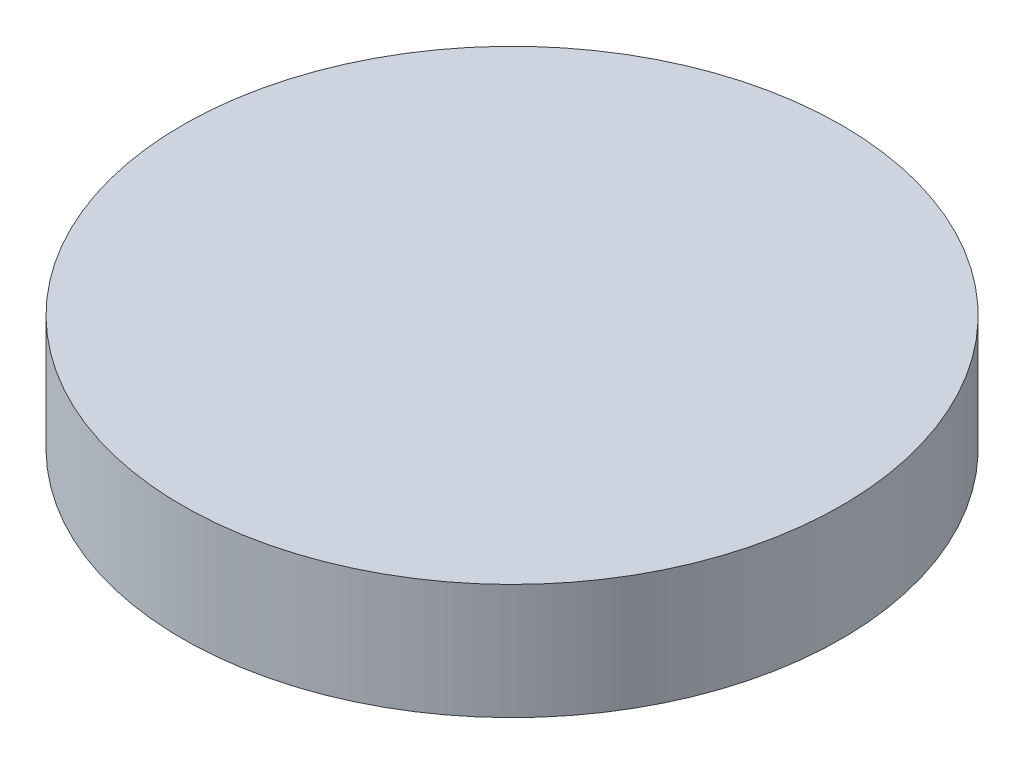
ISO-10303-21;
HEADER;
FILE_DESCRIPTION(('STEP AP214'),'2;1');
FILE_NAME('part.step','',(''),(''),'','','');
FILE_SCHEMA(('AUTOMOTIVE_DESIGN { 1 0 10303 214 1 1 1 1 }'));
ENDSEC;
DATA;
#1=APPLICATION_CONTEXT('core data for automotive mechanical design processes');
#2=APPLICATION_PROTOCOL_DEFINITION('international standard','automotive_design',2000,#1);
#3=PRODUCT_CONTEXT('',#1,'mechanical');
#4=PRODUCT('Part','Part','',(#3));
#5=PRODUCT_RELATED_PRODUCT_CATEGORY('part','',(#4));
#6=PRODUCT_DEFINITION_FORMATION('','',#4);
#7=PRODUCT_DEFINITION_CONTEXT('part definition',#1,'design');
#8=PRODUCT_DEFINITION('design','',#6,#7);
#9=PRODUCT_DEFINITION_SHAPE('','',#8);
#10=(LENGTH_UNIT() NAMED_UNIT(*) SI_UNIT(.MILLI.,.METRE.));
#11=(NAMED_UNIT(*) PLANE_ANGLE_UNIT() SI_UNIT($,.RADIAN.));
#12=(NAMED_UNIT(*) SI_UNIT($,.STERADIAN.) SOLID_ANGLE_UNIT());
#13=UNCERTAINTY_MEASURE_WITH_UNIT(LENGTH_MEASURE(1.E-05),#10,'distance_accuracy_value','');
#14=(GEOMETRIC_REPRESENTATION_CONTEXT(3) GLOBAL_UNCERTAINTY_ASSIGNED_CONTEXT((#13)) GLOBAL_UNIT_ASSIGNED_CONTEXT((#10,
#11,#12)) REPRESENTATION_CONTEXT('',''));
#15=CARTESIAN_POINT('',(0.,0.,0.));
#16=DIRECTION('',(0.,0.,1.));
#17=DIRECTION('',(1.,0.,0.));
#18=AXIS2_PLACEMENT_3D('',#15,#16,#17);
#19=CARTESIAN_POINT('',(0.,400.,0.));
#20=DIRECTION('',(0.,-1.,0.));
#21=DIRECTION('',(0.,0.,-1.));
#22=AXIS2_PLACEMENT_3D('',#19,#20,#21);
#23=PLANE('',#22);
#24=CARTESIAN_POINT('',(0.,400.,0.));
#25=DIRECTION('',(0.,-1.,0.));
#26=DIRECTION('',(0.,0.,-1.));
#27=AXIS2_PLACEMENT_3D('',#24,#25,#26);
#28=CIRCLE('',#27,800.);
#29=CARTESIAN_POINT('',(0.,400.,-800.));
#30=VERTEX_POINT('',#29);
#31=EDGE_CURVE('E10',#30,#30,#28,.T.);
#32=ORIENTED_EDGE('',*,*,#31,.F.);
#33=EDGE_LOOP('',(#32));
#34=FACE_BOUND('',#33,.T.);
#35=ADVANCED_FACE('F33',(#34),#23,.F.);
#36=CARTESIAN_POINT('',(0.,0.,0.));
#37=DIRECTION('',(0.,-1.,0.));
#38=DIRECTION('',(0.,0.,-1.));
#39=AXIS2_PLACEMENT_3D('',#36,#37,#38);
#40=CYLINDRICAL_SURFACE('',#39,800.);
#41=CARTESIAN_POINT('',(0.,120.,0.));
#42=DIRECTION('',(0.,-1.,0.));
#43=DIRECTION('',(0.,0.,-1.));
#44=AXIS2_PLACEMENT_3D('',#41,#42,#43);
#45=CIRCLE('',#44,800.);
#46=CARTESIAN_POINT('',(0.,120.,-800.));
#47=VERTEX_POINT('',#46);
#48=EDGE_CURVE('E39',#47,#47,#45,.T.);
#49=ORIENTED_EDGE('',*,*,#48,.F.);
#50=EDGE_LOOP('',(#49));
#51=FACE_BOUND('',#50,.T.);
#52=ORIENTED_EDGE('',*,*,#31,.T.);
#53=EDGE_LOOP('',(#52));
#54=FACE_BOUND('',#53,.T.);
#55=ADVANCED_FACE('F54',(#51,#54),#40,.T.);
#56=CARTESIAN_POINT('',(0.,120.,0.));
#57=DIRECTION('',(0.,1.,0.));
#58=DIRECTION('',(0.,0.,1.));
#59=AXIS2_PLACEMENT_3D('',#56,#57,#58);
#60=CONICAL_SURFACE('',#59,800.,1.03037682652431);
#61=CARTESIAN_POINT('',(0.,0.,0.));
#62=DIRECTION('',(0.,-1.,0.));
#63=DIRECTION('',(0.,0.,-1.));
#64=AXIS2_PLACEMENT_3D('',#61,#62,#63);
#65=CIRCLE('',#64,600.);
#66=CARTESIAN_POINT('',(0.,0.,-600.));
#67=VERTEX_POINT('',#66);
#68=EDGE_CURVE('E43',#67,#67,#65,.T.);
#69=ORIENTED_EDGE('',*,*,#68,.F.);
#70=EDGE_LOOP('',(#69));
#71=FACE_BOUND('',#70,.T.);
#72=ORIENTED_EDGE('',*,*,#48,.T.);
#73=EDGE_LOOP('',(#72));
#74=FACE_BOUND('',#73,.T.);
#75=ADVANCED_FACE('F52',(#71,#74),#60,.T.);
#76=CARTESIAN_POINT('',(-600.,0.,0.));
#77=DIRECTION('',(0.,1.,0.));
#78=DIRECTION('',(0.,0.,1.));
#79=AXIS2_PLACEMENT_3D('',#76,#77,#78);
#80=PLANE('',#79);
#81=ORIENTED_EDGE('',*,*,#68,.T.);
#82=EDGE_LOOP('',(#81));
#83=FACE_BOUND('',#82,.T.);
#84=ADVANCED_FACE('F50',(#83),#80,.F.);
#85=CLOSED_SHELL('',(#35,#55,#75,#84));
#86=MANIFOLD_SOLID_BREP('B2',#85);
#87=ADVANCED_BREP_SHAPE_REPRESENTATION('',(#18,#86),#14);
#88=SHAPE_DEFINITION_REPRESENTATION(#9,#87);
ENDSEC;
END-ISO-10303-21;
